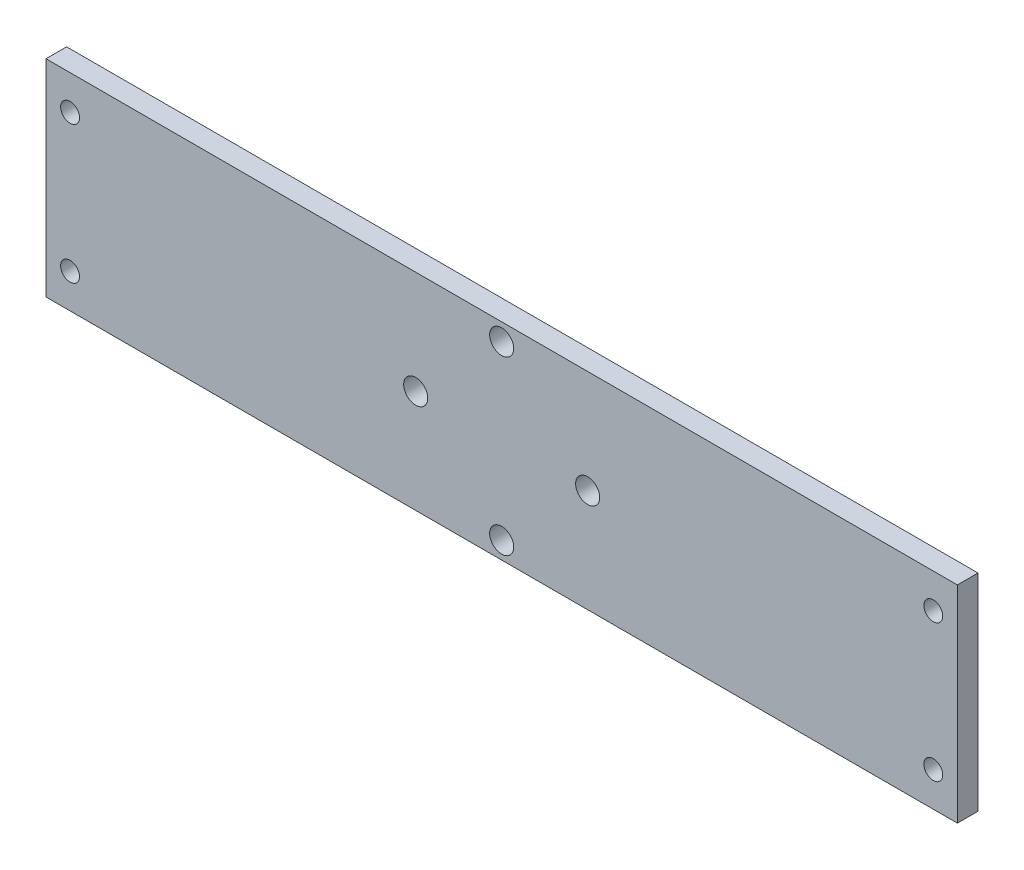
ISO-10303-21;
HEADER;
FILE_DESCRIPTION(('STEP AP214'),'2;1');
FILE_NAME('part.step','',(''),(''),'','','');
FILE_SCHEMA(('AUTOMOTIVE_DESIGN { 1 0 10303 214 1 1 1 1 }'));
ENDSEC;
DATA;
#1=APPLICATION_CONTEXT('core data for automotive mechanical design processes');
#2=APPLICATION_PROTOCOL_DEFINITION('international standard','automotive_design',2000,#1);
#3=PRODUCT_CONTEXT('',#1,'mechanical');
#4=PRODUCT('Part','Part','',(#3));
#5=PRODUCT_RELATED_PRODUCT_CATEGORY('part','',(#4));
#6=PRODUCT_DEFINITION_FORMATION('','',#4);
#7=PRODUCT_DEFINITION_CONTEXT('part definition',#1,'design');
#8=PRODUCT_DEFINITION('design','',#6,#7);
#9=PRODUCT_DEFINITION_SHAPE('','',#8);
#10=(LENGTH_UNIT() NAMED_UNIT(*) SI_UNIT(.MILLI.,.METRE.));
#11=(NAMED_UNIT(*) PLANE_ANGLE_UNIT() SI_UNIT($,.RADIAN.));
#12=(NAMED_UNIT(*) SI_UNIT($,.STERADIAN.) SOLID_ANGLE_UNIT());
#13=UNCERTAINTY_MEASURE_WITH_UNIT(LENGTH_MEASURE(1.E-05),#10,'distance_accuracy_value','');
#14=(GEOMETRIC_REPRESENTATION_CONTEXT(3) GLOBAL_UNCERTAINTY_ASSIGNED_CONTEXT((#13)) GLOBAL_UNIT_ASSIGNED_CONTEXT((#10,
#11,#12)) REPRESENTATION_CONTEXT('',''));
#15=CARTESIAN_POINT('',(0.,0.,0.));
#16=DIRECTION('',(0.,0.,1.));
#17=DIRECTION('',(1.,0.,0.));
#18=AXIS2_PLACEMENT_3D('',#15,#16,#17);
#19=CARTESIAN_POINT('',(0.,0.,6.));
#20=DIRECTION('',(0.,0.,1.));
#21=DIRECTION('',(1.,0.,0.));
#22=AXIS2_PLACEMENT_3D('',#19,#20,#21);
#23=PLANE('',#22);
#24=CARTESIAN_POINT('',(-1.74574066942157E-13,-25.,6.));
#25=DIRECTION('',(0.,0.,1.));
#26=DIRECTION('',(1.,0.,0.));
#27=AXIS2_PLACEMENT_3D('',#24,#25,#26);
#28=CIRCLE('',#27,3.5);
#29=CARTESIAN_POINT('',(3.49999999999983,-25.,6.));
#30=VERTEX_POINT('',#29);
#31=EDGE_CURVE('E145',#30,#30,#28,.T.);
#32=ORIENTED_EDGE('',*,*,#31,.F.);
#33=EDGE_LOOP('',(#32));
#34=FACE_BOUND('',#33,.T.);
#35=CARTESIAN_POINT('',(0.,25.,6.));
#36=DIRECTION('',(0.,0.,1.));
#37=DIRECTION('',(1.,0.,0.));
#38=AXIS2_PLACEMENT_3D('',#35,#36,#37);
#39=CIRCLE('',#38,3.5);
#40=CARTESIAN_POINT('',(3.5,25.,6.));
#41=VERTEX_POINT('',#40);
#42=EDGE_CURVE('E133',#41,#41,#39,.T.);
#43=ORIENTED_EDGE('',*,*,#42,.F.);
#44=EDGE_LOOP('',(#43));
#45=FACE_BOUND('',#44,.T.);
#46=CARTESIAN_POINT('',(125.5,-19.9999999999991,6.));
#47=DIRECTION('',(0.,0.,1.));
#48=DIRECTION('',(1.,0.,0.));
#49=AXIS2_PLACEMENT_3D('',#46,#47,#48);
#50=CIRCLE('',#49,2.75000000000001);
#51=CARTESIAN_POINT('',(128.25,-19.9999999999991,6.));
#52=VERTEX_POINT('',#51);
#53=EDGE_CURVE('E121',#52,#52,#50,.T.);
#54=ORIENTED_EDGE('',*,*,#53,.F.);
#55=EDGE_LOOP('',(#54));
#56=FACE_BOUND('',#55,.T.);
#57=CARTESIAN_POINT('',(-125.5,20.,6.));
#58=DIRECTION('',(0.,0.,1.));
#59=DIRECTION('',(1.,0.,0.));
#60=AXIS2_PLACEMENT_3D('',#57,#58,#59);
#61=CIRCLE('',#60,2.75000000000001);
#62=CARTESIAN_POINT('',(-122.75,20.,6.));
#63=VERTEX_POINT('',#62);
#64=EDGE_CURVE('E100',#63,#63,#61,.T.);
#65=ORIENTED_EDGE('',*,*,#64,.F.);
#66=EDGE_LOOP('',(#65));
#67=FACE_BOUND('',#66,.T.);
#68=DIRECTION('',(0.,1.,0.));
#69=VECTOR('',#68,1.);
#70=CARTESIAN_POINT('',(132.5,30.,6.));
#71=LINE('',#70,#69);
#72=CARTESIAN_POINT('',(132.5,-30.,6.));
#73=VERTEX_POINT('',#72);
#74=CARTESIAN_POINT('',(132.5,30.,6.));
#75=VERTEX_POINT('',#74);
#76=EDGE_CURVE('E85',#73,#75,#71,.T.);
#77=ORIENTED_EDGE('',*,*,#76,.T.);
#78=DIRECTION('',(-1.,0.,0.));
#79=VECTOR('',#78,1.);
#80=CARTESIAN_POINT('',(-132.5,30.,6.));
#81=LINE('',#80,#79);
#82=CARTESIAN_POINT('',(-132.5,30.,6.));
#83=VERTEX_POINT('',#82);
#84=EDGE_CURVE('E80',#75,#83,#81,.T.);
#85=ORIENTED_EDGE('',*,*,#84,.T.);
#86=DIRECTION('',(0.,-1.,0.));
#87=VECTOR('',#86,1.);
#88=CARTESIAN_POINT('',(-132.5,30.,6.));
#89=LINE('',#88,#87);
#90=CARTESIAN_POINT('',(-132.5,-30.,6.));
#91=VERTEX_POINT('',#90);
#92=EDGE_CURVE('E83',#83,#91,#89,.T.);
#93=ORIENTED_EDGE('',*,*,#92,.T.);
#94=DIRECTION('',(1.,0.,0.));
#95=VECTOR('',#94,1.);
#96=CARTESIAN_POINT('',(-132.5,-30.,6.));
#97=LINE('',#96,#95);
#98=EDGE_CURVE('E50',#91,#73,#97,.T.);
#99=ORIENTED_EDGE('',*,*,#98,.T.);
#100=EDGE_LOOP('',(#77,#85,#93,#99));
#101=FACE_BOUND('',#100,.T.);
#102=CARTESIAN_POINT('',(-125.5,-20.,6.));
#103=DIRECTION('',(0.,0.,1.));
#104=DIRECTION('',(-1.,0.,0.));
#105=AXIS2_PLACEMENT_3D('',#102,#103,#104);
#106=CIRCLE('',#105,2.75000000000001);
#107=CARTESIAN_POINT('',(-128.25,-20.,6.));
#108=VERTEX_POINT('',#107);
#109=EDGE_CURVE('E115',#108,#108,#106,.T.);
#110=ORIENTED_EDGE('',*,*,#109,.F.);
#111=EDGE_LOOP('',(#110));
#112=FACE_BOUND('',#111,.T.);
#113=CARTESIAN_POINT('',(125.5,20.0000000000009,6.));
#114=DIRECTION('',(0.,0.,1.));
#115=DIRECTION('',(-1.,0.,0.));
#116=AXIS2_PLACEMENT_3D('',#113,#114,#115);
#117=CIRCLE('',#116,2.75000000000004);
#118=CARTESIAN_POINT('',(122.75,20.0000000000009,6.));
#119=VERTEX_POINT('',#118);
#120=EDGE_CURVE('E127',#119,#119,#117,.T.);
#121=ORIENTED_EDGE('',*,*,#120,.F.);
#122=EDGE_LOOP('',(#121));
#123=FACE_BOUND('',#122,.T.);
#124=CARTESIAN_POINT('',(25.,0.,6.));
#125=DIRECTION('',(0.,0.,1.));
#126=DIRECTION('',(1.,0.,0.));
#127=AXIS2_PLACEMENT_3D('',#124,#125,#126);
#128=CIRCLE('',#127,3.5);
#129=CARTESIAN_POINT('',(28.5,0.,6.));
#130=VERTEX_POINT('',#129);
#131=EDGE_CURVE('E139',#130,#130,#128,.T.);
#132=ORIENTED_EDGE('',*,*,#131,.F.);
#133=EDGE_LOOP('',(#132));
#134=FACE_BOUND('',#133,.T.);
#135=CARTESIAN_POINT('',(-25.,2.61861100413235E-13,6.));
#136=DIRECTION('',(0.,0.,1.));
#137=DIRECTION('',(1.,0.,0.));
#138=AXIS2_PLACEMENT_3D('',#135,#136,#137);
#139=CIRCLE('',#138,3.5);
#140=CARTESIAN_POINT('',(-21.5,2.61861100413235E-13,6.));
#141=VERTEX_POINT('',#140);
#142=EDGE_CURVE('E151',#141,#141,#139,.T.);
#143=ORIENTED_EDGE('',*,*,#142,.F.);
#144=EDGE_LOOP('',(#143));
#145=FACE_BOUND('',#144,.T.);
#146=ADVANCED_FACE('F33',(#34,#45,#56,#67,#101,#112,#123,#134,#145),#23,.T.);
#147=CARTESIAN_POINT('',(0.,0.,0.));
#148=DIRECTION('',(0.,0.,1.));
#149=DIRECTION('',(1.,0.,0.));
#150=AXIS2_PLACEMENT_3D('',#147,#148,#149);
#151=PLANE('',#150);
#152=DIRECTION('',(0.,1.,0.));
#153=VECTOR('',#152,1.);
#154=CARTESIAN_POINT('',(132.5,30.,0.));
#155=LINE('',#154,#153);
#156=CARTESIAN_POINT('',(132.5,-30.,0.));
#157=VERTEX_POINT('',#156);
#158=CARTESIAN_POINT('',(132.5,30.,0.));
#159=VERTEX_POINT('',#158);
#160=EDGE_CURVE('E97',#157,#159,#155,.T.);
#161=ORIENTED_EDGE('',*,*,#160,.F.);
#162=DIRECTION('',(1.,0.,0.));
#163=VECTOR('',#162,1.);
#164=CARTESIAN_POINT('',(-132.5,-30.,0.));
#165=LINE('',#164,#163);
#166=CARTESIAN_POINT('',(-132.5,-30.,0.));
#167=VERTEX_POINT('',#166);
#168=EDGE_CURVE('E73',#167,#157,#165,.T.);
#169=ORIENTED_EDGE('',*,*,#168,.F.);
#170=DIRECTION('',(0.,-1.,0.));
#171=VECTOR('',#170,1.);
#172=CARTESIAN_POINT('',(-132.5,30.,0.));
#173=LINE('',#172,#171);
#174=CARTESIAN_POINT('',(-132.5,30.,0.));
#175=VERTEX_POINT('',#174);
#176=EDGE_CURVE('E67',#175,#167,#173,.T.);
#177=ORIENTED_EDGE('',*,*,#176,.F.);
#178=DIRECTION('',(-1.,0.,0.));
#179=VECTOR('',#178,1.);
#180=CARTESIAN_POINT('',(-132.5,30.,0.));
#181=LINE('',#180,#179);
#182=EDGE_CURVE('E89',#159,#175,#181,.T.);
#183=ORIENTED_EDGE('',*,*,#182,.F.);
#184=EDGE_LOOP('',(#161,#169,#177,#183));
#185=FACE_BOUND('',#184,.T.);
#186=CARTESIAN_POINT('',(-125.5,20.,0.));
#187=DIRECTION('',(0.,0.,1.));
#188=DIRECTION('',(1.,0.,0.));
#189=AXIS2_PLACEMENT_3D('',#186,#187,#188);
#190=CIRCLE('',#189,2.75000000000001);
#191=CARTESIAN_POINT('',(-122.75,20.,0.));
#192=VERTEX_POINT('',#191);
#193=EDGE_CURVE('E112',#192,#192,#190,.T.);
#194=ORIENTED_EDGE('',*,*,#193,.T.);
#195=EDGE_LOOP('',(#194));
#196=FACE_BOUND('',#195,.T.);
#197=CARTESIAN_POINT('',(-125.5,-20.,0.));
#198=DIRECTION('',(0.,0.,1.));
#199=DIRECTION('',(-1.,0.,0.));
#200=AXIS2_PLACEMENT_3D('',#197,#198,#199);
#201=CIRCLE('',#200,2.75000000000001);
#202=CARTESIAN_POINT('',(-128.25,-20.,0.));
#203=VERTEX_POINT('',#202);
#204=EDGE_CURVE('E118',#203,#203,#201,.T.);
#205=ORIENTED_EDGE('',*,*,#204,.T.);
#206=EDGE_LOOP('',(#205));
#207=FACE_BOUND('',#206,.T.);
#208=CARTESIAN_POINT('',(125.5,-19.9999999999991,0.));
#209=DIRECTION('',(0.,0.,1.));
#210=DIRECTION('',(1.,0.,0.));
#211=AXIS2_PLACEMENT_3D('',#208,#209,#210);
#212=CIRCLE('',#211,2.75000000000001);
#213=CARTESIAN_POINT('',(128.25,-19.9999999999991,0.));
#214=VERTEX_POINT('',#213);
#215=EDGE_CURVE('E124',#214,#214,#212,.T.);
#216=ORIENTED_EDGE('',*,*,#215,.T.);
#217=EDGE_LOOP('',(#216));
#218=FACE_BOUND('',#217,.T.);
#219=CARTESIAN_POINT('',(125.5,20.0000000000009,0.));
#220=DIRECTION('',(0.,0.,1.));
#221=DIRECTION('',(-1.,0.,0.));
#222=AXIS2_PLACEMENT_3D('',#219,#220,#221);
#223=CIRCLE('',#222,2.75000000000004);
#224=CARTESIAN_POINT('',(122.75,20.0000000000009,0.));
#225=VERTEX_POINT('',#224);
#226=EDGE_CURVE('E130',#225,#225,#223,.T.);
#227=ORIENTED_EDGE('',*,*,#226,.T.);
#228=EDGE_LOOP('',(#227));
#229=FACE_BOUND('',#228,.T.);
#230=CARTESIAN_POINT('',(0.,25.,0.));
#231=DIRECTION('',(0.,0.,1.));
#232=DIRECTION('',(1.,0.,0.));
#233=AXIS2_PLACEMENT_3D('',#230,#231,#232);
#234=CIRCLE('',#233,3.5);
#235=CARTESIAN_POINT('',(3.5,25.,0.));
#236=VERTEX_POINT('',#235);
#237=EDGE_CURVE('E136',#236,#236,#234,.T.);
#238=ORIENTED_EDGE('',*,*,#237,.T.);
#239=EDGE_LOOP('',(#238));
#240=FACE_BOUND('',#239,.T.);
#241=CARTESIAN_POINT('',(25.,0.,0.));
#242=DIRECTION('',(0.,0.,1.));
#243=DIRECTION('',(1.,0.,0.));
#244=AXIS2_PLACEMENT_3D('',#241,#242,#243);
#245=CIRCLE('',#244,3.5);
#246=CARTESIAN_POINT('',(28.5,0.,0.));
#247=VERTEX_POINT('',#246);
#248=EDGE_CURVE('E142',#247,#247,#245,.T.);
#249=ORIENTED_EDGE('',*,*,#248,.T.);
#250=EDGE_LOOP('',(#249));
#251=FACE_BOUND('',#250,.T.);
#252=CARTESIAN_POINT('',(-1.74574066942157E-13,-25.,0.));
#253=DIRECTION('',(0.,0.,1.));
#254=DIRECTION('',(1.,0.,0.));
#255=AXIS2_PLACEMENT_3D('',#252,#253,#254);
#256=CIRCLE('',#255,3.5);
#257=CARTESIAN_POINT('',(3.49999999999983,-25.,0.));
#258=VERTEX_POINT('',#257);
#259=EDGE_CURVE('E148',#258,#258,#256,.T.);
#260=ORIENTED_EDGE('',*,*,#259,.T.);
#261=EDGE_LOOP('',(#260));
#262=FACE_BOUND('',#261,.T.);
#263=CARTESIAN_POINT('',(-25.,2.61861100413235E-13,0.));
#264=DIRECTION('',(0.,0.,1.));
#265=DIRECTION('',(1.,0.,0.));
#266=AXIS2_PLACEMENT_3D('',#263,#264,#265);
#267=CIRCLE('',#266,3.5);
#268=CARTESIAN_POINT('',(-21.5,2.61861100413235E-13,0.));
#269=VERTEX_POINT('',#268);
#270=EDGE_CURVE('E154',#269,#269,#267,.T.);
#271=ORIENTED_EDGE('',*,*,#270,.T.);
#272=EDGE_LOOP('',(#271));
#273=FACE_BOUND('',#272,.T.);
#274=ADVANCED_FACE('F108',(#185,#196,#207,#218,#229,#240,#251,#262,#273),#151,.F.);
#275=CARTESIAN_POINT('',(132.5,30.,6.));
#276=DIRECTION('',(-1.,0.,0.));
#277=DIRECTION('',(0.,0.,1.));
#278=AXIS2_PLACEMENT_3D('',#275,#276,#277);
#279=PLANE('',#278);
#280=ORIENTED_EDGE('',*,*,#160,.T.);
#281=DIRECTION('',(0.,0.,-1.));
#282=VECTOR('',#281,1.);
#283=CARTESIAN_POINT('',(132.5,30.,6.));
#284=LINE('',#283,#282);
#285=EDGE_CURVE('E11',#75,#159,#284,.T.);
#286=ORIENTED_EDGE('',*,*,#285,.F.);
#287=ORIENTED_EDGE('',*,*,#76,.F.);
#288=DIRECTION('',(0.,0.,-1.));
#289=VECTOR('',#288,1.);
#290=CARTESIAN_POINT('',(132.5,-30.,6.));
#291=LINE('',#290,#289);
#292=EDGE_CURVE('E93',#73,#157,#291,.T.);
#293=ORIENTED_EDGE('',*,*,#292,.T.);
#294=EDGE_LOOP('',(#280,#286,#287,#293));
#295=FACE_BOUND('',#294,.T.);
#296=ADVANCED_FACE('F35',(#295),#279,.F.);
#297=CARTESIAN_POINT('',(-132.5,30.,6.));
#298=DIRECTION('',(0.,-1.,0.));
#299=DIRECTION('',(0.,0.,-1.));
#300=AXIS2_PLACEMENT_3D('',#297,#298,#299);
#301=PLANE('',#300);
#302=ORIENTED_EDGE('',*,*,#182,.T.);
#303=DIRECTION('',(0.,0.,-1.));
#304=VECTOR('',#303,1.);
#305=CARTESIAN_POINT('',(-132.5,30.,6.));
#306=LINE('',#305,#304);
#307=EDGE_CURVE('E42',#83,#175,#306,.T.);
#308=ORIENTED_EDGE('',*,*,#307,.F.);
#309=ORIENTED_EDGE('',*,*,#84,.F.);
#310=ORIENTED_EDGE('',*,*,#285,.T.);
#311=EDGE_LOOP('',(#302,#308,#309,#310));
#312=FACE_BOUND('',#311,.T.);
#313=ADVANCED_FACE('F88',(#312),#301,.F.);
#314=CARTESIAN_POINT('',(-132.5,30.,6.));
#315=DIRECTION('',(1.,0.,0.));
#316=DIRECTION('',(0.,0.,-1.));
#317=AXIS2_PLACEMENT_3D('',#314,#315,#316);
#318=PLANE('',#317);
#319=ORIENTED_EDGE('',*,*,#176,.T.);
#320=DIRECTION('',(0.,0.,-1.));
#321=VECTOR('',#320,1.);
#322=CARTESIAN_POINT('',(-132.5,-30.,6.));
#323=LINE('',#322,#321);
#324=EDGE_CURVE('E90',#91,#167,#323,.T.);
#325=ORIENTED_EDGE('',*,*,#324,.F.);
#326=ORIENTED_EDGE('',*,*,#92,.F.);
#327=ORIENTED_EDGE('',*,*,#307,.T.);
#328=EDGE_LOOP('',(#319,#325,#326,#327));
#329=FACE_BOUND('',#328,.T.);
#330=ADVANCED_FACE('F91',(#329),#318,.F.);
#331=CARTESIAN_POINT('',(-132.5,-30.,6.));
#332=DIRECTION('',(0.,1.,0.));
#333=DIRECTION('',(0.,0.,1.));
#334=AXIS2_PLACEMENT_3D('',#331,#332,#333);
#335=PLANE('',#334);
#336=ORIENTED_EDGE('',*,*,#168,.T.);
#337=ORIENTED_EDGE('',*,*,#292,.F.);
#338=ORIENTED_EDGE('',*,*,#98,.F.);
#339=ORIENTED_EDGE('',*,*,#324,.T.);
#340=EDGE_LOOP('',(#336,#337,#338,#339));
#341=FACE_BOUND('',#340,.T.);
#342=ADVANCED_FACE('F105',(#341),#335,.F.);
#343=CARTESIAN_POINT('',(-125.5,20.,6.));
#344=DIRECTION('',(0.,0.,-1.));
#345=DIRECTION('',(-1.,0.,0.));
#346=AXIS2_PLACEMENT_3D('',#343,#344,#345);
#347=CYLINDRICAL_SURFACE('',#346,2.75000000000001);
#348=ORIENTED_EDGE('',*,*,#64,.T.);
#349=EDGE_LOOP('',(#348));
#350=FACE_BOUND('',#349,.T.);
#351=ORIENTED_EDGE('',*,*,#193,.F.);
#352=EDGE_LOOP('',(#351));
#353=FACE_BOUND('',#352,.T.);
#354=ADVANCED_FACE('F173',(#350,#353),#347,.F.);
#355=CARTESIAN_POINT('',(-125.5,-20.,6.));
#356=DIRECTION('',(0.,0.,-1.));
#357=DIRECTION('',(-1.,0.,0.));
#358=AXIS2_PLACEMENT_3D('',#355,#356,#357);
#359=CYLINDRICAL_SURFACE('',#358,2.75000000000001);
#360=ORIENTED_EDGE('',*,*,#109,.T.);
#361=EDGE_LOOP('',(#360));
#362=FACE_BOUND('',#361,.T.);
#363=ORIENTED_EDGE('',*,*,#204,.F.);
#364=EDGE_LOOP('',(#363));
#365=FACE_BOUND('',#364,.T.);
#366=ADVANCED_FACE('F219',(#362,#365),#359,.F.);
#367=CARTESIAN_POINT('',(125.5,-19.9999999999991,6.));
#368=DIRECTION('',(0.,0.,-1.));
#369=DIRECTION('',(-1.,0.,0.));
#370=AXIS2_PLACEMENT_3D('',#367,#368,#369);
#371=CYLINDRICAL_SURFACE('',#370,2.75000000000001);
#372=ORIENTED_EDGE('',*,*,#53,.T.);
#373=EDGE_LOOP('',(#372));
#374=FACE_BOUND('',#373,.T.);
#375=ORIENTED_EDGE('',*,*,#215,.F.);
#376=EDGE_LOOP('',(#375));
#377=FACE_BOUND('',#376,.T.);
#378=ADVANCED_FACE('F227',(#374,#377),#371,.F.);
#379=CARTESIAN_POINT('',(125.5,20.0000000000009,6.));
#380=DIRECTION('',(0.,0.,-1.));
#381=DIRECTION('',(-1.,0.,0.));
#382=AXIS2_PLACEMENT_3D('',#379,#380,#381);
#383=CYLINDRICAL_SURFACE('',#382,2.75000000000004);
#384=ORIENTED_EDGE('',*,*,#120,.T.);
#385=EDGE_LOOP('',(#384));
#386=FACE_BOUND('',#385,.T.);
#387=ORIENTED_EDGE('',*,*,#226,.F.);
#388=EDGE_LOOP('',(#387));
#389=FACE_BOUND('',#388,.T.);
#390=ADVANCED_FACE('F235',(#386,#389),#383,.F.);
#391=CARTESIAN_POINT('',(0.,25.,6.));
#392=DIRECTION('',(0.,0.,-1.));
#393=DIRECTION('',(-1.,0.,0.));
#394=AXIS2_PLACEMENT_3D('',#391,#392,#393);
#395=CYLINDRICAL_SURFACE('',#394,3.5);
#396=ORIENTED_EDGE('',*,*,#42,.T.);
#397=EDGE_LOOP('',(#396));
#398=FACE_BOUND('',#397,.T.);
#399=ORIENTED_EDGE('',*,*,#237,.F.);
#400=EDGE_LOOP('',(#399));
#401=FACE_BOUND('',#400,.T.);
#402=ADVANCED_FACE('F244',(#398,#401),#395,.F.);
#403=CARTESIAN_POINT('',(25.,0.,6.));
#404=DIRECTION('',(0.,0.,-1.));
#405=DIRECTION('',(-1.,0.,0.));
#406=AXIS2_PLACEMENT_3D('',#403,#404,#405);
#407=CYLINDRICAL_SURFACE('',#406,3.5);
#408=ORIENTED_EDGE('',*,*,#131,.T.);
#409=EDGE_LOOP('',(#408));
#410=FACE_BOUND('',#409,.T.);
#411=ORIENTED_EDGE('',*,*,#248,.F.);
#412=EDGE_LOOP('',(#411));
#413=FACE_BOUND('',#412,.T.);
#414=ADVANCED_FACE('F253',(#410,#413),#407,.F.);
#415=CARTESIAN_POINT('',(-1.74574066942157E-13,-25.,6.));
#416=DIRECTION('',(0.,0.,-1.));
#417=DIRECTION('',(-1.,0.,0.));
#418=AXIS2_PLACEMENT_3D('',#415,#416,#417);
#419=CYLINDRICAL_SURFACE('',#418,3.5);
#420=ORIENTED_EDGE('',*,*,#31,.T.);
#421=EDGE_LOOP('',(#420));
#422=FACE_BOUND('',#421,.T.);
#423=ORIENTED_EDGE('',*,*,#259,.F.);
#424=EDGE_LOOP('',(#423));
#425=FACE_BOUND('',#424,.T.);
#426=ADVANCED_FACE('F262',(#422,#425),#419,.F.);
#427=CARTESIAN_POINT('',(-25.,2.61861100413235E-13,6.));
#428=DIRECTION('',(0.,0.,-1.));
#429=DIRECTION('',(-1.,0.,0.));
#430=AXIS2_PLACEMENT_3D('',#427,#428,#429);
#431=CYLINDRICAL_SURFACE('',#430,3.5);
#432=ORIENTED_EDGE('',*,*,#142,.T.);
#433=EDGE_LOOP('',(#432));
#434=FACE_BOUND('',#433,.T.);
#435=ORIENTED_EDGE('',*,*,#270,.F.);
#436=EDGE_LOOP('',(#435));
#437=FACE_BOUND('',#436,.T.);
#438=ADVANCED_FACE('F160',(#434,#437),#431,.F.);
#439=CLOSED_SHELL('',(#146,#274,#296,#313,#330,#342,#354,#366,#378,#390,#402,#414,#426,#438));
#440=MANIFOLD_SOLID_BREP('B2',#439);
#441=ADVANCED_BREP_SHAPE_REPRESENTATION('',(#18,#440),#14);
#442=SHAPE_DEFINITION_REPRESENTATION(#9,#441);
ENDSEC;
END-ISO-10303-21;
